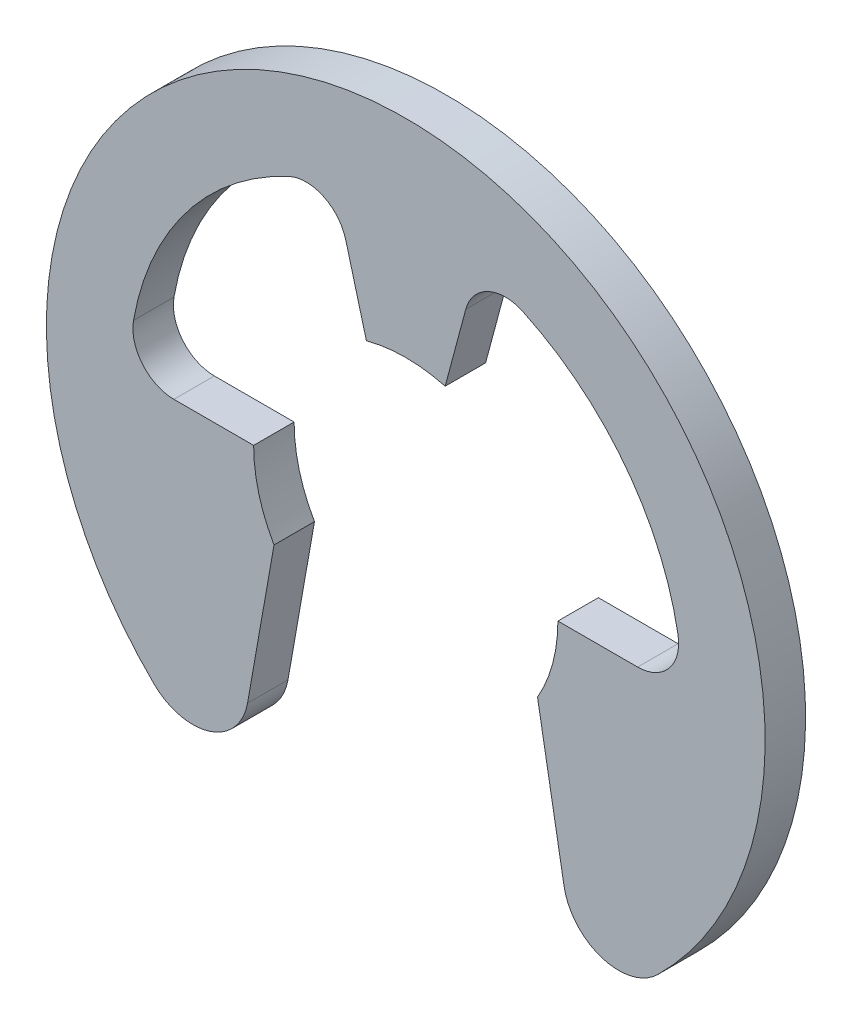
from build123d import *

# Parameters (mm, degrees)
BODY_DEPTH = 0.635


with BuildPart() as part:
    # BodySke → Body (new body)
    with BuildSketch(Plane.XY):
        with BuildLine():
            Line((2.067722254, -1.1938), (2.483619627, -3.552471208))
            ThreePointArc((2.483619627, -3.552471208), (3.076252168, -4.231234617), (3.952891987, -4.022822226))
            ThreePointArc((3.952891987, -4.022822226), (0, 5.639898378), (-3.952891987, -4.022822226))
            ThreePointArc((-3.952891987, -4.022822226), (-3.076252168, -4.231234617), (-2.483619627, -3.552471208))
            Line((-2.483619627, -3.552471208), (-2.067722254, -1.1938))
            ThreePointArc((-2.067722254, -1.1938), (-2.306244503, -0.617956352), (-2.3876, 0))
            Line((-2.3876, 0), (-3.63847823, 0))
            ThreePointArc((-3.63847823, 0), (-4.131908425, 0.230186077), (-4.272578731, 0.756181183))
            ThreePointArc((-4.272578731, 0.756181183), (-3.442343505, 2.641403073), (-1.836239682, 3.93128005))
            ThreePointArc((-1.836239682, 3.93128005), (-1.29175927, 3.931540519), (-0.941707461, 3.514500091))
            Line((-0.941707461, 3.514500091), (-0.617956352, 2.306244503))
            ThreePointArc((-0.617956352, 2.306244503), (0, 2.3876), (0.617956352, 2.306244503))
            Line((0.617956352, 2.306244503), (0.941707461, 3.514500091))
            ThreePointArc((0.941707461, 3.514500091), (1.29175927, 3.931540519), (1.836239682, 3.93128005))
            ThreePointArc((1.836239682, 3.93128005), (3.442343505, 2.641403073), (4.272578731, 0.756181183))
            ThreePointArc((4.272578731, 0.756181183), (4.131908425, 0.230186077), (3.63847823, 0))
            Line((3.63847823, 0), (2.3876, 0))
            ThreePointArc((2.3876, 0), (2.306244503, -0.617956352), (2.067722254, -1.1938))
        make_face()
    extrude(amount=-BODY_DEPTH)


solid = part.part
